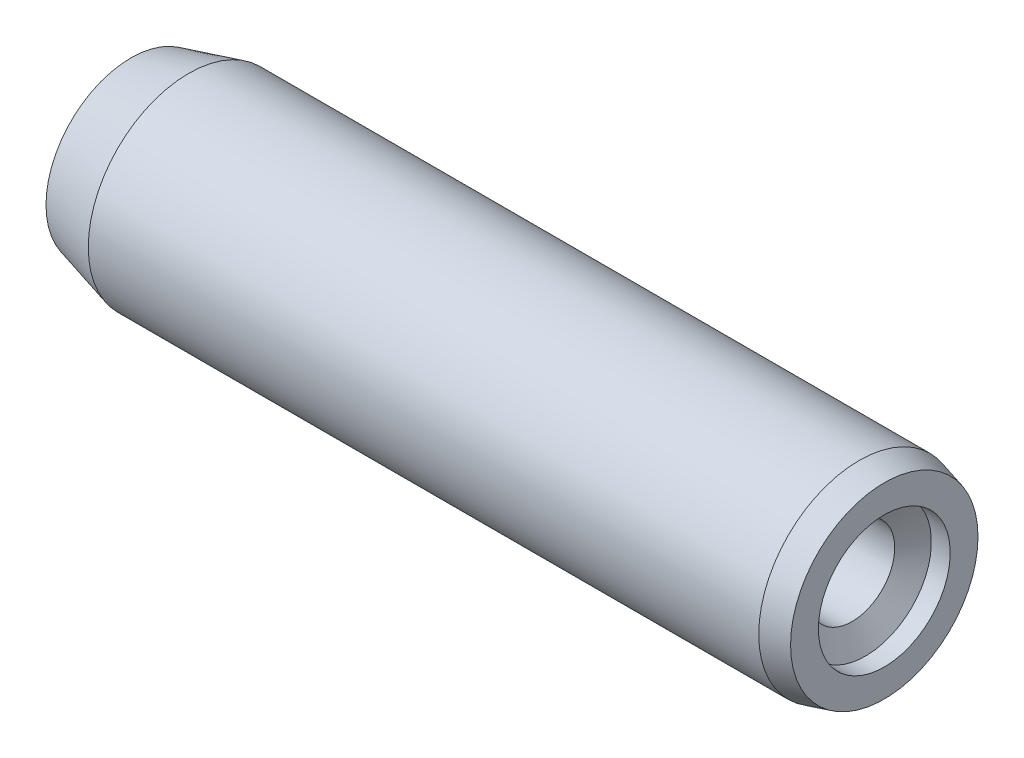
ISO-10303-21;
HEADER;
FILE_DESCRIPTION(('STEP AP214'),'2;1');
FILE_NAME('part.step','',(''),(''),'','','');
FILE_SCHEMA(('AUTOMOTIVE_DESIGN { 1 0 10303 214 1 1 1 1 }'));
ENDSEC;
DATA;
#1=APPLICATION_CONTEXT('core data for automotive mechanical design processes');
#2=APPLICATION_PROTOCOL_DEFINITION('international standard','automotive_design',2000,#1);
#3=PRODUCT_CONTEXT('',#1,'mechanical');
#4=PRODUCT('Part','Part','',(#3));
#5=PRODUCT_RELATED_PRODUCT_CATEGORY('part','',(#4));
#6=PRODUCT_DEFINITION_FORMATION('','',#4);
#7=PRODUCT_DEFINITION_CONTEXT('part definition',#1,'design');
#8=PRODUCT_DEFINITION('design','',#6,#7);
#9=PRODUCT_DEFINITION_SHAPE('','',#8);
#10=(LENGTH_UNIT() NAMED_UNIT(*) SI_UNIT(.MILLI.,.METRE.));
#11=(NAMED_UNIT(*) PLANE_ANGLE_UNIT() SI_UNIT($,.RADIAN.));
#12=(NAMED_UNIT(*) SI_UNIT($,.STERADIAN.) SOLID_ANGLE_UNIT());
#13=UNCERTAINTY_MEASURE_WITH_UNIT(LENGTH_MEASURE(1.E-05),#10,'distance_accuracy_value','');
#14=(GEOMETRIC_REPRESENTATION_CONTEXT(3) GLOBAL_UNCERTAINTY_ASSIGNED_CONTEXT((#13)) GLOBAL_UNIT_ASSIGNED_CONTEXT((#10,
#11,#12)) REPRESENTATION_CONTEXT('',''));
#15=CARTESIAN_POINT('',(0.,0.,0.));
#16=DIRECTION('',(0.,0.,1.));
#17=DIRECTION('',(1.,0.,0.));
#18=AXIS2_PLACEMENT_3D('',#15,#16,#17);
#19=CARTESIAN_POINT('',(60.,7.46410161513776,0.));
#20=DIRECTION('',(-1.,0.,0.));
#21=DIRECTION('',(0.,0.,1.));
#22=AXIS2_PLACEMENT_3D('',#19,#20,#21);
#23=PLANE('',#22);
#24=CARTESIAN_POINT('',(60.,0.,0.));
#25=DIRECTION('',(-1.,0.,0.));
#26=DIRECTION('',(0.,0.,1.));
#27=AXIS2_PLACEMENT_3D('',#24,#25,#26);
#28=CIRCLE('',#27,7.46410161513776);
#29=CARTESIAN_POINT('',(60.,0.,7.46410161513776));
#30=VERTEX_POINT('',#29);
#31=EDGE_CURVE('E73',#30,#30,#28,.T.);
#32=ORIENTED_EDGE('',*,*,#31,.F.);
#33=EDGE_LOOP('',(#32));
#34=FACE_BOUND('',#33,.T.);
#35=CARTESIAN_POINT('',(60.,0.,0.));
#36=DIRECTION('',(-1.,0.,0.));
#37=DIRECTION('',(0.,0.,1.));
#38=AXIS2_PLACEMENT_3D('',#35,#36,#37);
#39=CIRCLE('',#38,5.25);
#40=CARTESIAN_POINT('',(60.,0.,5.25));
#41=VERTEX_POINT('',#40);
#42=EDGE_CURVE('E11',#41,#41,#39,.T.);
#43=ORIENTED_EDGE('',*,*,#42,.T.);
#44=EDGE_LOOP('',(#43));
#45=FACE_BOUND('',#44,.T.);
#46=ADVANCED_FACE('F37',(#34,#45),#23,.F.);
#47=CARTESIAN_POINT('',(0.,0.,0.));
#48=DIRECTION('',(-1.,0.,0.));
#49=DIRECTION('',(0.,0.,1.));
#50=AXIS2_PLACEMENT_3D('',#47,#48,#49);
#51=CYLINDRICAL_SURFACE('',#50,5.25);
#52=ORIENTED_EDGE('',*,*,#42,.F.);
#53=EDGE_LOOP('',(#52));
#54=FACE_BOUND('',#53,.T.);
#55=CARTESIAN_POINT('',(58.5,0.,0.));
#56=DIRECTION('',(-1.,0.,0.));
#57=DIRECTION('',(0.,0.,1.));
#58=AXIS2_PLACEMENT_3D('',#55,#56,#57);
#59=CIRCLE('',#58,5.25);
#60=CARTESIAN_POINT('',(58.5,0.,5.25));
#61=VERTEX_POINT('',#60);
#62=EDGE_CURVE('E43',#61,#61,#59,.T.);
#63=ORIENTED_EDGE('',*,*,#62,.T.);
#64=EDGE_LOOP('',(#63));
#65=FACE_BOUND('',#64,.T.);
#66=ADVANCED_FACE('F64',(#54,#65),#51,.F.);
#67=CARTESIAN_POINT('',(57.4319020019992,0.,0.));
#68=DIRECTION('',(1.,0.,0.));
#69=DIRECTION('',(0.,0.,-1.));
#70=AXIS2_PLACEMENT_3D('',#67,#68,#69);
#71=CONICAL_SURFACE('',#70,3.4,1.0471975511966);
#72=ORIENTED_EDGE('',*,*,#62,.F.);
#73=EDGE_LOOP('',(#72));
#74=FACE_BOUND('',#73,.T.);
#75=CARTESIAN_POINT('',(57.4319020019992,0.,0.));
#76=DIRECTION('',(-1.,0.,0.));
#77=DIRECTION('',(0.,0.,1.));
#78=AXIS2_PLACEMENT_3D('',#75,#76,#77);
#79=CIRCLE('',#78,3.4);
#80=CARTESIAN_POINT('',(57.4319020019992,0.,3.4));
#81=VERTEX_POINT('',#80);
#82=EDGE_CURVE('E79',#81,#81,#79,.T.);
#83=ORIENTED_EDGE('',*,*,#82,.T.);
#84=EDGE_LOOP('',(#83));
#85=FACE_BOUND('',#84,.T.);
#86=ADVANCED_FACE('F59',(#74,#85),#71,.F.);
#87=CARTESIAN_POINT('',(0.,0.,0.));
#88=DIRECTION('',(-1.,0.,0.));
#89=DIRECTION('',(0.,0.,1.));
#90=AXIS2_PLACEMENT_3D('',#87,#88,#89);
#91=CYLINDRICAL_SURFACE('',#90,3.4);
#92=ORIENTED_EDGE('',*,*,#82,.F.);
#93=EDGE_LOOP('',(#92));
#94=FACE_BOUND('',#93,.T.);
#95=CARTESIAN_POINT('',(35.,0.,0.));
#96=DIRECTION('',(-1.,0.,0.));
#97=DIRECTION('',(0.,0.,1.));
#98=AXIS2_PLACEMENT_3D('',#95,#96,#97);
#99=CIRCLE('',#98,3.4);
#100=CARTESIAN_POINT('',(35.,0.,3.4));
#101=VERTEX_POINT('',#100);
#102=EDGE_CURVE('E81',#101,#101,#99,.T.);
#103=ORIENTED_EDGE('',*,*,#102,.T.);
#104=EDGE_LOOP('',(#103));
#105=FACE_BOUND('',#104,.T.);
#106=ADVANCED_FACE('F49',(#94,#105),#91,.F.);
#107=CARTESIAN_POINT('',(33.5916738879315,0.,0.));
#108=DIRECTION('',(1.,0.,0.));
#109=DIRECTION('',(0.,0.,-1.));
#110=AXIS2_PLACEMENT_3D('',#107,#108,#109);
#111=CONICAL_SURFACE('',#110,0.,1.17809724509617);
#112=ORIENTED_EDGE('',*,*,#102,.F.);
#113=EDGE_LOOP('',(#112));
#114=FACE_BOUND('',#113,.T.);
#115=CARTESIAN_POINT('',(33.5916738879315,0.,0.));
#116=VERTEX_POINT('',#115);
#117=VERTEX_LOOP('',#116);
#118=FACE_BOUND('',#117,.T.);
#119=ADVANCED_FACE('F46',(#114,#118),#111,.F.);
#120=CARTESIAN_POINT('',(0.,0.,0.));
#121=DIRECTION('',(1.,0.,0.));
#122=DIRECTION('',(0.,0.,-1.));
#123=AXIS2_PLACEMENT_3D('',#120,#121,#122);
#124=PLANE('',#123);
#125=CARTESIAN_POINT('',(0.,0.,0.));
#126=DIRECTION('',(-1.,0.,0.));
#127=DIRECTION('',(0.,0.,1.));
#128=AXIS2_PLACEMENT_3D('',#125,#126,#127);
#129=CIRCLE('',#128,6.76743371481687);
#130=CARTESIAN_POINT('',(0.,0.,6.76743371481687));
#131=VERTEX_POINT('',#130);
#132=EDGE_CURVE('E86',#131,#131,#129,.T.);
#133=ORIENTED_EDGE('',*,*,#132,.T.);
#134=EDGE_LOOP('',(#133));
#135=FACE_BOUND('',#134,.T.);
#136=ADVANCED_FACE('F48',(#135),#124,.F.);
#137=CARTESIAN_POINT('',(4.6,0.,0.));
#138=DIRECTION('',(1.,0.,0.));
#139=DIRECTION('',(0.,0.,-1.));
#140=AXIS2_PLACEMENT_3D('',#137,#138,#139);
#141=CONICAL_SURFACE('',#140,8.,0.261799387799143);
#142=ORIENTED_EDGE('',*,*,#132,.F.);
#143=EDGE_LOOP('',(#142));
#144=FACE_BOUND('',#143,.T.);
#145=CARTESIAN_POINT('',(4.6,0.,0.));
#146=DIRECTION('',(-1.,0.,0.));
#147=DIRECTION('',(0.,0.,1.));
#148=AXIS2_PLACEMENT_3D('',#145,#146,#147);
#149=CIRCLE('',#148,8.);
#150=CARTESIAN_POINT('',(4.6,0.,8.));
#151=VERTEX_POINT('',#150);
#152=EDGE_CURVE('E89',#151,#151,#149,.T.);
#153=ORIENTED_EDGE('',*,*,#152,.T.);
#154=EDGE_LOOP('',(#153));
#155=FACE_BOUND('',#154,.T.);
#156=ADVANCED_FACE('F56',(#144,#155),#141,.T.);
#157=CARTESIAN_POINT('',(0.,0.,0.));
#158=DIRECTION('',(-1.,0.,0.));
#159=DIRECTION('',(0.,0.,1.));
#160=AXIS2_PLACEMENT_3D('',#157,#158,#159);
#161=CYLINDRICAL_SURFACE('',#160,8.);
#162=ORIENTED_EDGE('',*,*,#152,.F.);
#163=EDGE_LOOP('',(#162));
#164=FACE_BOUND('',#163,.T.);
#165=CARTESIAN_POINT('',(58.,0.,0.));
#166=DIRECTION('',(-1.,0.,0.));
#167=DIRECTION('',(0.,0.,1.));
#168=AXIS2_PLACEMENT_3D('',#165,#166,#167);
#169=CIRCLE('',#168,8.);
#170=CARTESIAN_POINT('',(58.,0.,8.));
#171=VERTEX_POINT('',#170);
#172=EDGE_CURVE('E92',#171,#171,#169,.T.);
#173=ORIENTED_EDGE('',*,*,#172,.T.);
#174=EDGE_LOOP('',(#173));
#175=FACE_BOUND('',#174,.T.);
#176=ADVANCED_FACE('F98',(#164,#175),#161,.T.);
#177=CARTESIAN_POINT('',(60.,0.,0.));
#178=DIRECTION('',(-1.,0.,0.));
#179=DIRECTION('',(0.,0.,1.));
#180=AXIS2_PLACEMENT_3D('',#177,#178,#179);
#181=CONICAL_SURFACE('',#180,7.46410161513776,0.261799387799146);
#182=ORIENTED_EDGE('',*,*,#172,.F.);
#183=EDGE_LOOP('',(#182));
#184=FACE_BOUND('',#183,.T.);
#185=ORIENTED_EDGE('',*,*,#31,.T.);
#186=EDGE_LOOP('',(#185));
#187=FACE_BOUND('',#186,.T.);
#188=ADVANCED_FACE('F96',(#184,#187),#181,.T.);
#189=CLOSED_SHELL('',(#46,#66,#86,#106,#119,#136,#156,#176,#188));
#190=MANIFOLD_SOLID_BREP('B2',#189);
#191=ADVANCED_BREP_SHAPE_REPRESENTATION('',(#18,#190),#14);
#192=SHAPE_DEFINITION_REPRESENTATION(#9,#191);
ENDSEC;
END-ISO-10303-21;
